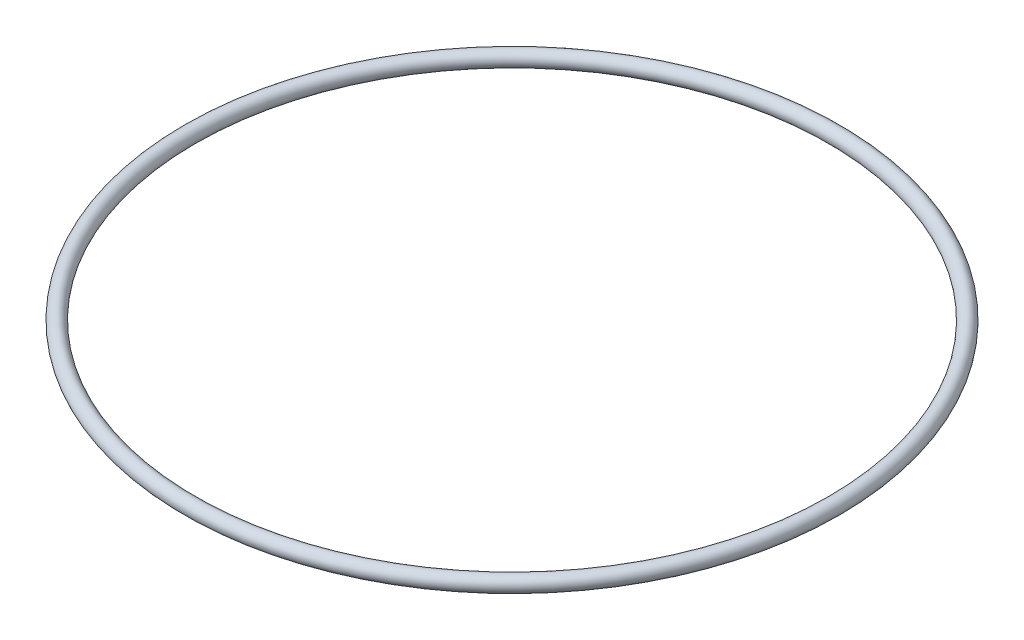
ISO-10303-21;
HEADER;
FILE_DESCRIPTION(('STEP AP214'),'2;1');
FILE_NAME('part.step','',(''),(''),'','','');
FILE_SCHEMA(('AUTOMOTIVE_DESIGN { 1 0 10303 214 1 1 1 1 }'));
ENDSEC;
DATA;
#1=APPLICATION_CONTEXT('core data for automotive mechanical design processes');
#2=APPLICATION_PROTOCOL_DEFINITION('international standard','automotive_design',2000,#1);
#3=PRODUCT_CONTEXT('',#1,'mechanical');
#4=PRODUCT('Part','Part','',(#3));
#5=PRODUCT_RELATED_PRODUCT_CATEGORY('part','',(#4));
#6=PRODUCT_DEFINITION_FORMATION('','',#4);
#7=PRODUCT_DEFINITION_CONTEXT('part definition',#1,'design');
#8=PRODUCT_DEFINITION('design','',#6,#7);
#9=PRODUCT_DEFINITION_SHAPE('','',#8);
#10=(LENGTH_UNIT() NAMED_UNIT(*) SI_UNIT(.MILLI.,.METRE.));
#11=(NAMED_UNIT(*) PLANE_ANGLE_UNIT() SI_UNIT($,.RADIAN.));
#12=(NAMED_UNIT(*) SI_UNIT($,.STERADIAN.) SOLID_ANGLE_UNIT());
#13=UNCERTAINTY_MEASURE_WITH_UNIT(LENGTH_MEASURE(1.E-05),#10,'distance_accuracy_value','');
#14=(GEOMETRIC_REPRESENTATION_CONTEXT(3) GLOBAL_UNCERTAINTY_ASSIGNED_CONTEXT((#13)) GLOBAL_UNIT_ASSIGNED_CONTEXT((#10,
#11,#12)) REPRESENTATION_CONTEXT('',''));
#15=CARTESIAN_POINT('',(0.,0.,0.));
#16=DIRECTION('',(0.,0.,1.));
#17=DIRECTION('',(1.,0.,0.));
#18=AXIS2_PLACEMENT_3D('',#15,#16,#17);
#19=CARTESIAN_POINT('',(0.,0.,0.));
#20=DIRECTION('',(0.,1.,0.));
#21=DIRECTION('',(-1.,0.,0.));
#22=AXIS2_PLACEMENT_3D('',#19,#20,#21);
#23=TOROIDAL_SURFACE('',#22,84.5,2.);
#24=CARTESIAN_POINT('',(-86.5,0.,0.));
#25=VERTEX_POINT('',#24);
#26=VERTEX_LOOP('',#25);
#27=FACE_BOUND('',#26,.T.);
#28=ADVANCED_FACE('F29',(#27),#23,.T.);
#29=CLOSED_SHELL('',(#28));
#30=MANIFOLD_SOLID_BREP('B2',#29);
#31=ADVANCED_BREP_SHAPE_REPRESENTATION('',(#18,#30),#14);
#32=SHAPE_DEFINITION_REPRESENTATION(#9,#31);
ENDSEC;
END-ISO-10303-21;
